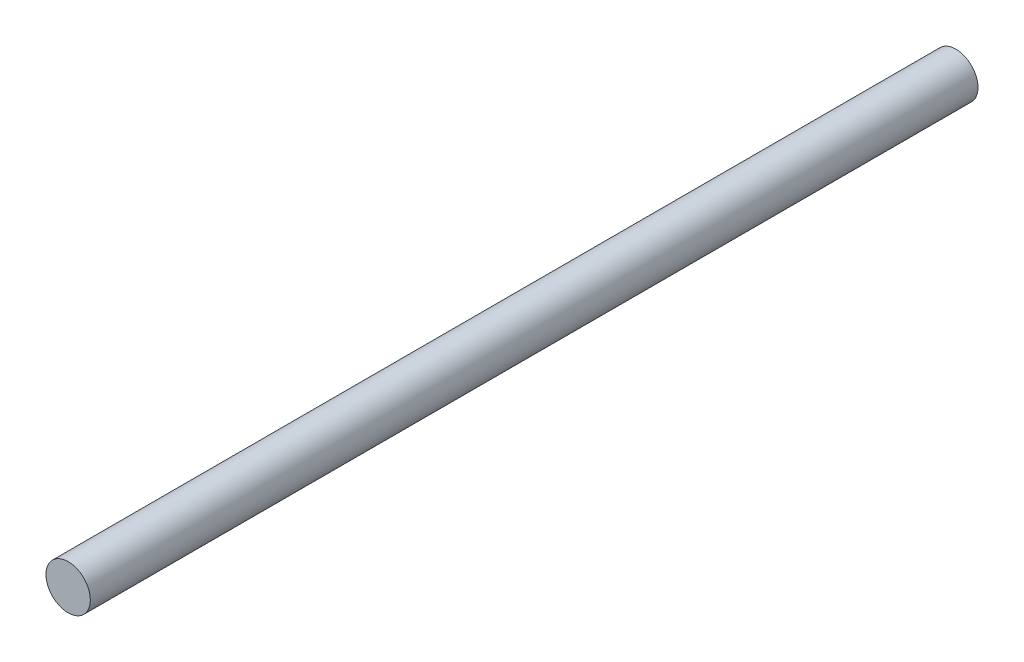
from build123d import *

# Parameters (mm, degrees)
SKETCH1_R           = 30
BOSS_EXTRUDE1_DEPTH = 1200


with BuildPart() as part:
    # Sketch1 → Boss-Extrude1 (new body)
    with BuildSketch(Plane.XY):
        Circle(SKETCH1_R)
    extrude(amount=-BOSS_EXTRUDE1_DEPTH)


solid = part.part
